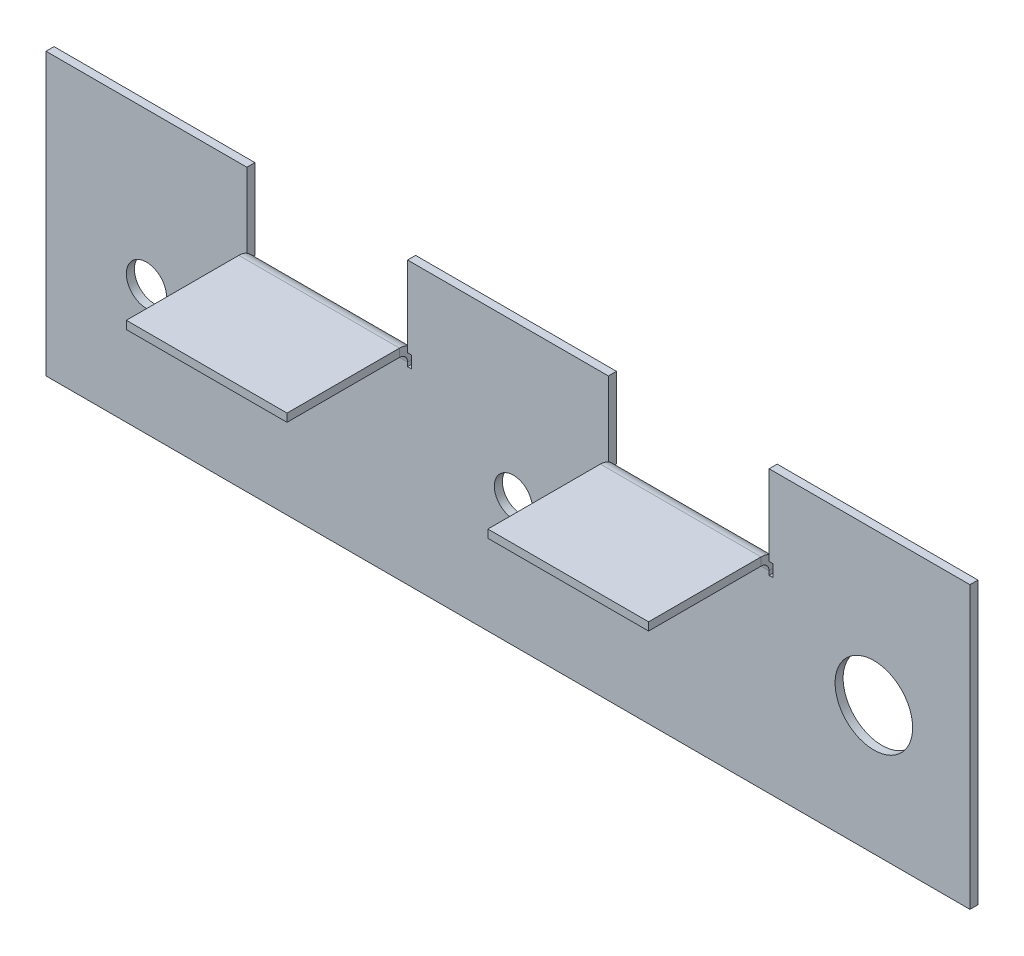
ISO-10303-21;
HEADER;
FILE_DESCRIPTION(('STEP AP214'),'2;1');
FILE_NAME('part.step','',(''),(''),'','','');
FILE_SCHEMA(('AUTOMOTIVE_DESIGN { 1 0 10303 214 1 1 1 1 }'));
ENDSEC;
DATA;
#1=APPLICATION_CONTEXT('core data for automotive mechanical design processes');
#2=APPLICATION_PROTOCOL_DEFINITION('international standard','automotive_design',2000,#1);
#3=PRODUCT_CONTEXT('',#1,'mechanical');
#4=PRODUCT('Part','Part','',(#3));
#5=PRODUCT_RELATED_PRODUCT_CATEGORY('part','',(#4));
#6=PRODUCT_DEFINITION_FORMATION('','',#4);
#7=PRODUCT_DEFINITION_CONTEXT('part definition',#1,'design');
#8=PRODUCT_DEFINITION('design','',#6,#7);
#9=PRODUCT_DEFINITION_SHAPE('','',#8);
#10=(LENGTH_UNIT() NAMED_UNIT(*) SI_UNIT(.MILLI.,.METRE.));
#11=(NAMED_UNIT(*) PLANE_ANGLE_UNIT() SI_UNIT($,.RADIAN.));
#12=(NAMED_UNIT(*) SI_UNIT($,.STERADIAN.) SOLID_ANGLE_UNIT());
#13=UNCERTAINTY_MEASURE_WITH_UNIT(LENGTH_MEASURE(1.E-05),#10,'distance_accuracy_value','');
#14=(GEOMETRIC_REPRESENTATION_CONTEXT(3) GLOBAL_UNCERTAINTY_ASSIGNED_CONTEXT((#13)) GLOBAL_UNIT_ASSIGNED_CONTEXT((#10,
#11,#12)) REPRESENTATION_CONTEXT('',''));
#15=CARTESIAN_POINT('',(0.,0.,0.));
#16=DIRECTION('',(0.,0.,1.));
#17=DIRECTION('',(1.,0.,0.));
#18=AXIS2_PLACEMENT_3D('',#15,#16,#17);
#19=CARTESIAN_POINT('',(0.,0.,1.));
#20=DIRECTION('',(0.,0.,-1.));
#21=DIRECTION('',(-1.,0.,0.));
#22=AXIS2_PLACEMENT_3D('',#19,#20,#21);
#23=PLANE('',#22);
#24=CARTESIAN_POINT('',(58.1713524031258,16.021629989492,1.));
#25=DIRECTION('',(0.,0.,1.));
#26=DIRECTION('',(1.,0.,0.));
#27=AXIS2_PLACEMENT_3D('',#24,#25,#26);
#28=CIRCLE('',#27,2.36837023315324);
#29=CARTESIAN_POINT('',(60.539722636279,16.021629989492,1.));
#30=VERTEX_POINT('',#29);
#31=EDGE_CURVE('E326',#30,#30,#28,.T.);
#32=ORIENTED_EDGE('',*,*,#31,.F.);
#33=EDGE_LOOP('',(#32));
#34=FACE_BOUND('',#33,.T.);
#35=CARTESIAN_POINT('',(12.5,16.021629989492,1.));
#36=DIRECTION('',(0.,0.,1.));
#37=DIRECTION('',(1.,0.,0.));
#38=AXIS2_PLACEMENT_3D('',#35,#36,#37);
#39=CIRCLE('',#38,2.49994635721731);
#40=CARTESIAN_POINT('',(14.9999463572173,16.021629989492,1.));
#41=VERTEX_POINT('',#40);
#42=EDGE_CURVE('E149',#41,#41,#39,.T.);
#43=ORIENTED_EDGE('',*,*,#42,.F.);
#44=EDGE_LOOP('',(#43));
#45=FACE_BOUND('',#44,.T.);
#46=CARTESIAN_POINT('',(103.038810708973,16.021629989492,1.));
#47=DIRECTION('',(0.,0.,1.));
#48=DIRECTION('',(1.,0.,0.));
#49=AXIS2_PLACEMENT_3D('',#46,#47,#48);
#50=CIRCLE('',#49,4.8254545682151);
#51=CARTESIAN_POINT('',(107.864265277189,16.021629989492,1.));
#52=VERTEX_POINT('',#51);
#53=EDGE_CURVE('E320',#52,#52,#50,.T.);
#54=ORIENTED_EDGE('',*,*,#53,.F.);
#55=EDGE_LOOP('',(#54));
#56=FACE_BOUND('',#55,.T.);
#57=DIRECTION('',(-1.,0.,0.));
#58=VECTOR('',#57,1.);
#59=CARTESIAN_POINT('',(70.,25.,1.));
#60=LINE('',#59,#58);
#61=CARTESIAN_POINT('',(70.,25.,1.));
#62=VERTEX_POINT('',#61);
#63=CARTESIAN_POINT('',(69.5,25.,1.));
#64=VERTEX_POINT('',#63);
#65=EDGE_CURVE('E270',#62,#64,#60,.T.);
#66=ORIENTED_EDGE('',*,*,#65,.F.);
#67=DIRECTION('',(0.,1.,0.));
#68=VECTOR('',#67,1.);
#69=CARTESIAN_POINT('',(70.,35.,1.));
#70=LINE('',#69,#68);
#71=CARTESIAN_POINT('',(70.,35.,1.));
#72=VERTEX_POINT('',#71);
#73=EDGE_CURVE('E343',#62,#72,#70,.T.);
#74=ORIENTED_EDGE('',*,*,#73,.T.);
#75=DIRECTION('',(-1.,0.,0.));
#76=VECTOR('',#75,1.);
#77=CARTESIAN_POINT('',(45.,35.,1.));
#78=LINE('',#77,#76);
#79=CARTESIAN_POINT('',(45.,35.,1.));
#80=VERTEX_POINT('',#79);
#81=EDGE_CURVE('E345',#72,#80,#78,.T.);
#82=ORIENTED_EDGE('',*,*,#81,.T.);
#83=DIRECTION('',(0.,-1.,0.));
#84=VECTOR('',#83,1.);
#85=CARTESIAN_POINT('',(45.,25.,1.));
#86=LINE('',#85,#84);
#87=CARTESIAN_POINT('',(45.,25.,1.));
#88=VERTEX_POINT('',#87);
#89=EDGE_CURVE('E130',#80,#88,#86,.T.);
#90=ORIENTED_EDGE('',*,*,#89,.T.);
#91=DIRECTION('',(-1.,0.,0.));
#92=VECTOR('',#91,1.);
#93=CARTESIAN_POINT('',(45.5,25.,1.));
#94=LINE('',#93,#92);
#95=CARTESIAN_POINT('',(45.5,25.,1.));
#96=VERTEX_POINT('',#95);
#97=EDGE_CURVE('E299',#96,#88,#94,.T.);
#98=ORIENTED_EDGE('',*,*,#97,.F.);
#99=DIRECTION('',(0.,1.,0.));
#100=VECTOR('',#99,1.);
#101=CARTESIAN_POINT('',(45.5,23.5,1.));
#102=LINE('',#101,#100);
#103=CARTESIAN_POINT('',(45.5,23.5,1.));
#104=VERTEX_POINT('',#103);
#105=EDGE_CURVE('E295',#104,#96,#102,.T.);
#106=ORIENTED_EDGE('',*,*,#105,.F.);
#107=DIRECTION('',(1.,0.,0.));
#108=VECTOR('',#107,1.);
#109=CARTESIAN_POINT('',(45.,23.5,1.));
#110=LINE('',#109,#108);
#111=CARTESIAN_POINT('',(45.,23.5,1.));
#112=VERTEX_POINT('',#111);
#113=EDGE_CURVE('E291',#112,#104,#110,.T.);
#114=ORIENTED_EDGE('',*,*,#113,.F.);
#115=DIRECTION('',(0.,-1.,0.));
#116=VECTOR('',#115,1.);
#117=CARTESIAN_POINT('',(45.,24.,1.));
#118=LINE('',#117,#116);
#119=CARTESIAN_POINT('',(45.,24.,1.));
#120=VERTEX_POINT('',#119);
#121=EDGE_CURVE('E288',#120,#112,#118,.T.);
#122=ORIENTED_EDGE('',*,*,#121,.F.);
#123=DIRECTION('',(-1.,0.,0.));
#124=VECTOR('',#123,1.);
#125=CARTESIAN_POINT('',(25.,24.,1.));
#126=LINE('',#125,#124);
#127=CARTESIAN_POINT('',(25.,24.,1.));
#128=VERTEX_POINT('',#127);
#129=EDGE_CURVE('E421',#128,#120,#126,.F.);
#130=ORIENTED_EDGE('',*,*,#129,.F.);
#131=DIRECTION('',(0.,1.,0.));
#132=VECTOR('',#131,1.);
#133=CARTESIAN_POINT('',(25.,23.5,1.));
#134=LINE('',#133,#132);
#135=CARTESIAN_POINT('',(25.,23.5,1.));
#136=VERTEX_POINT('',#135);
#137=EDGE_CURVE('E284',#136,#128,#134,.T.);
#138=ORIENTED_EDGE('',*,*,#137,.F.);
#139=DIRECTION('',(1.,0.,0.));
#140=VECTOR('',#139,1.);
#141=CARTESIAN_POINT('',(24.5,23.5,1.));
#142=LINE('',#141,#140);
#143=CARTESIAN_POINT('',(24.5,23.5,1.));
#144=VERTEX_POINT('',#143);
#145=EDGE_CURVE('E280',#144,#136,#142,.T.);
#146=ORIENTED_EDGE('',*,*,#145,.F.);
#147=DIRECTION('',(0.,-1.,0.));
#148=VECTOR('',#147,1.);
#149=CARTESIAN_POINT('',(24.5,25.,1.));
#150=LINE('',#149,#148);
#151=CARTESIAN_POINT('',(24.5,25.,1.));
#152=VERTEX_POINT('',#151);
#153=EDGE_CURVE('E276',#152,#144,#150,.T.);
#154=ORIENTED_EDGE('',*,*,#153,.F.);
#155=DIRECTION('',(-1.,0.,0.));
#156=VECTOR('',#155,1.);
#157=CARTESIAN_POINT('',(25.,25.,1.));
#158=LINE('',#157,#156);
#159=CARTESIAN_POINT('',(25.,25.,1.));
#160=VERTEX_POINT('',#159);
#161=EDGE_CURVE('E127',#160,#152,#158,.T.);
#162=ORIENTED_EDGE('',*,*,#161,.F.);
#163=DIRECTION('',(0.,1.,0.));
#164=VECTOR('',#163,1.);
#165=CARTESIAN_POINT('',(25.,35.,1.));
#166=LINE('',#165,#164);
#167=CARTESIAN_POINT('',(25.,35.,1.));
#168=VERTEX_POINT('',#167);
#169=EDGE_CURVE('E119',#160,#168,#166,.T.);
#170=ORIENTED_EDGE('',*,*,#169,.T.);
#171=DIRECTION('',(-1.,0.,0.));
#172=VECTOR('',#171,1.);
#173=CARTESIAN_POINT('',(0.,35.,1.));
#174=LINE('',#173,#172);
#175=CARTESIAN_POINT('',(0.,35.,1.));
#176=VERTEX_POINT('',#175);
#177=EDGE_CURVE('E123',#168,#176,#174,.T.);
#178=ORIENTED_EDGE('',*,*,#177,.T.);
#179=DIRECTION('',(0.,-1.,0.));
#180=VECTOR('',#179,1.);
#181=CARTESIAN_POINT('',(0.,0.,1.));
#182=LINE('',#181,#180);
#183=CARTESIAN_POINT('',(0.,0.,1.));
#184=VERTEX_POINT('',#183);
#185=EDGE_CURVE('E52',#176,#184,#182,.T.);
#186=ORIENTED_EDGE('',*,*,#185,.T.);
#187=DIRECTION('',(1.,0.,0.));
#188=VECTOR('',#187,1.);
#189=CARTESIAN_POINT('',(115.,0.,1.));
#190=LINE('',#189,#188);
#191=CARTESIAN_POINT('',(115.,0.,1.));
#192=VERTEX_POINT('',#191);
#193=EDGE_CURVE('E166',#184,#192,#190,.T.);
#194=ORIENTED_EDGE('',*,*,#193,.T.);
#195=DIRECTION('',(0.,1.,0.));
#196=VECTOR('',#195,1.);
#197=CARTESIAN_POINT('',(115.,35.,1.));
#198=LINE('',#197,#196);
#199=CARTESIAN_POINT('',(115.,35.,1.));
#200=VERTEX_POINT('',#199);
#201=EDGE_CURVE('E103',#192,#200,#198,.T.);
#202=ORIENTED_EDGE('',*,*,#201,.T.);
#203=DIRECTION('',(-1.,0.,0.));
#204=VECTOR('',#203,1.);
#205=CARTESIAN_POINT('',(90.,35.,1.));
#206=LINE('',#205,#204);
#207=CARTESIAN_POINT('',(90.,35.,1.));
#208=VERTEX_POINT('',#207);
#209=EDGE_CURVE('E338',#200,#208,#206,.T.);
#210=ORIENTED_EDGE('',*,*,#209,.T.);
#211=DIRECTION('',(0.,-1.,0.));
#212=VECTOR('',#211,1.);
#213=CARTESIAN_POINT('',(90.,25.,1.));
#214=LINE('',#213,#212);
#215=CARTESIAN_POINT('',(90.,25.,1.));
#216=VERTEX_POINT('',#215);
#217=EDGE_CURVE('E340',#208,#216,#214,.T.);
#218=ORIENTED_EDGE('',*,*,#217,.T.);
#219=DIRECTION('',(-1.,0.,0.));
#220=VECTOR('',#219,1.);
#221=CARTESIAN_POINT('',(90.5,25.,1.));
#222=LINE('',#221,#220);
#223=CARTESIAN_POINT('',(90.5,25.,1.));
#224=VERTEX_POINT('',#223);
#225=EDGE_CURVE('E460',#224,#216,#222,.T.);
#226=ORIENTED_EDGE('',*,*,#225,.F.);
#227=DIRECTION('',(0.,1.,0.));
#228=VECTOR('',#227,1.);
#229=CARTESIAN_POINT('',(90.5,23.5,1.));
#230=LINE('',#229,#228);
#231=CARTESIAN_POINT('',(90.5,23.5,1.));
#232=VERTEX_POINT('',#231);
#233=EDGE_CURVE('E456',#232,#224,#230,.T.);
#234=ORIENTED_EDGE('',*,*,#233,.F.);
#235=DIRECTION('',(1.,0.,0.));
#236=VECTOR('',#235,1.);
#237=CARTESIAN_POINT('',(90.,23.5,1.));
#238=LINE('',#237,#236);
#239=CARTESIAN_POINT('',(90.,23.5,1.));
#240=VERTEX_POINT('',#239);
#241=EDGE_CURVE('E452',#240,#232,#238,.T.);
#242=ORIENTED_EDGE('',*,*,#241,.F.);
#243=DIRECTION('',(0.,-1.,0.));
#244=VECTOR('',#243,1.);
#245=CARTESIAN_POINT('',(90.,24.,1.));
#246=LINE('',#245,#244);
#247=CARTESIAN_POINT('',(90.,24.,1.));
#248=VERTEX_POINT('',#247);
#249=EDGE_CURVE('E449',#248,#240,#246,.T.);
#250=ORIENTED_EDGE('',*,*,#249,.F.);
#251=DIRECTION('',(-1.,0.,0.));
#252=VECTOR('',#251,1.);
#253=CARTESIAN_POINT('',(70.,24.,1.));
#254=LINE('',#253,#252);
#255=CARTESIAN_POINT('',(70.,24.,1.));
#256=VERTEX_POINT('',#255);
#257=EDGE_CURVE('E501',#256,#248,#254,.F.);
#258=ORIENTED_EDGE('',*,*,#257,.F.);
#259=DIRECTION('',(0.,1.,0.));
#260=VECTOR('',#259,1.);
#261=CARTESIAN_POINT('',(70.,23.5,1.));
#262=LINE('',#261,#260);
#263=CARTESIAN_POINT('',(70.,23.5,1.));
#264=VERTEX_POINT('',#263);
#265=EDGE_CURVE('E257',#264,#256,#262,.T.);
#266=ORIENTED_EDGE('',*,*,#265,.F.);
#267=DIRECTION('',(1.,0.,0.));
#268=VECTOR('',#267,1.);
#269=CARTESIAN_POINT('',(69.5,23.5,1.));
#270=LINE('',#269,#268);
#271=CARTESIAN_POINT('',(69.5,23.5,1.));
#272=VERTEX_POINT('',#271);
#273=EDGE_CURVE('E256',#272,#264,#270,.T.);
#274=ORIENTED_EDGE('',*,*,#273,.F.);
#275=DIRECTION('',(0.,-1.,0.));
#276=VECTOR('',#275,1.);
#277=CARTESIAN_POINT('',(69.5,25.,1.));
#278=LINE('',#277,#276);
#279=EDGE_CURVE('E254',#64,#272,#278,.T.);
#280=ORIENTED_EDGE('',*,*,#279,.F.);
#281=EDGE_LOOP('',(#66,#74,#82,#90,#98,#106,#114,#122,#130,#138,#146,#154,#162,#170,#178,#186,
#194,#202,#210,#218,#226,#234,#242,#250,#258,#266,#274,#280));
#282=FACE_BOUND('',#281,.T.);
#283=ADVANCED_FACE('F35',(#34,#45,#56,#282),#23,.F.);
#284=CARTESIAN_POINT('',(0.,0.,0.));
#285=DIRECTION('',(0.,0.,-1.));
#286=DIRECTION('',(-1.,0.,0.));
#287=AXIS2_PLACEMENT_3D('',#284,#285,#286);
#288=PLANE('',#287);
#289=CARTESIAN_POINT('',(58.1713524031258,16.021629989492,0.));
#290=DIRECTION('',(0.,0.,1.));
#291=DIRECTION('',(1.,0.,0.));
#292=AXIS2_PLACEMENT_3D('',#289,#290,#291);
#293=CIRCLE('',#292,2.36837023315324);
#294=CARTESIAN_POINT('',(60.539722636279,16.021629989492,0.));
#295=VERTEX_POINT('',#294);
#296=EDGE_CURVE('E323',#295,#295,#293,.T.);
#297=ORIENTED_EDGE('',*,*,#296,.T.);
#298=EDGE_LOOP('',(#297));
#299=FACE_BOUND('',#298,.T.);
#300=CARTESIAN_POINT('',(12.5,16.021629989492,0.));
#301=DIRECTION('',(0.,0.,1.));
#302=DIRECTION('',(1.,0.,0.));
#303=AXIS2_PLACEMENT_3D('',#300,#301,#302);
#304=CIRCLE('',#303,2.49994635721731);
#305=CARTESIAN_POINT('',(14.9999463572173,16.021629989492,0.));
#306=VERTEX_POINT('',#305);
#307=EDGE_CURVE('E329',#306,#306,#304,.T.);
#308=ORIENTED_EDGE('',*,*,#307,.T.);
#309=EDGE_LOOP('',(#308));
#310=FACE_BOUND('',#309,.T.);
#311=CARTESIAN_POINT('',(103.038810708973,16.021629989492,0.));
#312=DIRECTION('',(0.,0.,1.));
#313=DIRECTION('',(1.,0.,0.));
#314=AXIS2_PLACEMENT_3D('',#311,#312,#313);
#315=CIRCLE('',#314,4.8254545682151);
#316=CARTESIAN_POINT('',(107.864265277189,16.021629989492,0.));
#317=VERTEX_POINT('',#316);
#318=EDGE_CURVE('E319',#317,#317,#315,.T.);
#319=ORIENTED_EDGE('',*,*,#318,.T.);
#320=EDGE_LOOP('',(#319));
#321=FACE_BOUND('',#320,.T.);
#322=DIRECTION('',(0.,1.,0.));
#323=VECTOR('',#322,1.);
#324=CARTESIAN_POINT('',(70.,35.,0.));
#325=LINE('',#324,#323);
#326=CARTESIAN_POINT('',(70.,25.,0.));
#327=VERTEX_POINT('',#326);
#328=CARTESIAN_POINT('',(70.,35.,0.));
#329=VERTEX_POINT('',#328);
#330=EDGE_CURVE('E156',#327,#329,#325,.T.);
#331=ORIENTED_EDGE('',*,*,#330,.F.);
#332=DIRECTION('',(-1.,0.,0.));
#333=VECTOR('',#332,1.);
#334=CARTESIAN_POINT('',(0.,25.,0.));
#335=LINE('',#334,#333);
#336=CARTESIAN_POINT('',(69.5,25.,0.));
#337=VERTEX_POINT('',#336);
#338=EDGE_CURVE('E267',#327,#337,#335,.T.);
#339=ORIENTED_EDGE('',*,*,#338,.T.);
#340=DIRECTION('',(0.,-1.,0.));
#341=VECTOR('',#340,1.);
#342=CARTESIAN_POINT('',(69.5,0.,0.));
#343=LINE('',#342,#341);
#344=CARTESIAN_POINT('',(69.5,23.5,0.));
#345=VERTEX_POINT('',#344);
#346=EDGE_CURVE('E11',#337,#345,#343,.T.);
#347=ORIENTED_EDGE('',*,*,#346,.T.);
#348=DIRECTION('',(1.,0.,0.));
#349=VECTOR('',#348,1.);
#350=CARTESIAN_POINT('',(0.,23.5,0.));
#351=LINE('',#350,#349);
#352=CARTESIAN_POINT('',(70.,23.5,0.));
#353=VERTEX_POINT('',#352);
#354=EDGE_CURVE('E44',#345,#353,#351,.T.);
#355=ORIENTED_EDGE('',*,*,#354,.T.);
#356=DIRECTION('',(0.,1.,0.));
#357=VECTOR('',#356,1.);
#358=CARTESIAN_POINT('',(70.,0.,0.));
#359=LINE('',#358,#357);
#360=CARTESIAN_POINT('',(70.,24.,0.));
#361=VERTEX_POINT('',#360);
#362=EDGE_CURVE('E220',#353,#361,#359,.T.);
#363=ORIENTED_EDGE('',*,*,#362,.T.);
#364=DIRECTION('',(-1.,0.,0.));
#365=VECTOR('',#364,1.);
#366=CARTESIAN_POINT('',(70.,24.,0.));
#367=LINE('',#366,#365);
#368=CARTESIAN_POINT('',(90.,24.,0.));
#369=VERTEX_POINT('',#368);
#370=EDGE_CURVE('E481',#361,#369,#367,.F.);
#371=ORIENTED_EDGE('',*,*,#370,.T.);
#372=DIRECTION('',(0.,-1.,0.));
#373=VECTOR('',#372,1.);
#374=CARTESIAN_POINT('',(90.,0.,0.));
#375=LINE('',#374,#373);
#376=CARTESIAN_POINT('',(90.,23.5,0.));
#377=VERTEX_POINT('',#376);
#378=EDGE_CURVE('E217',#369,#377,#375,.T.);
#379=ORIENTED_EDGE('',*,*,#378,.T.);
#380=DIRECTION('',(1.,0.,0.));
#381=VECTOR('',#380,1.);
#382=CARTESIAN_POINT('',(0.,23.5,0.));
#383=LINE('',#382,#381);
#384=CARTESIAN_POINT('',(90.5,23.5,0.));
#385=VERTEX_POINT('',#384);
#386=EDGE_CURVE('E214',#377,#385,#383,.T.);
#387=ORIENTED_EDGE('',*,*,#386,.T.);
#388=DIRECTION('',(0.,1.,0.));
#389=VECTOR('',#388,1.);
#390=CARTESIAN_POINT('',(90.5,0.,0.));
#391=LINE('',#390,#389);
#392=CARTESIAN_POINT('',(90.5,25.,0.));
#393=VERTEX_POINT('',#392);
#394=EDGE_CURVE('E211',#385,#393,#391,.T.);
#395=ORIENTED_EDGE('',*,*,#394,.T.);
#396=DIRECTION('',(-1.,0.,0.));
#397=VECTOR('',#396,1.);
#398=CARTESIAN_POINT('',(0.,25.,0.));
#399=LINE('',#398,#397);
#400=CARTESIAN_POINT('',(90.,25.,0.));
#401=VERTEX_POINT('',#400);
#402=EDGE_CURVE('E269',#393,#401,#399,.T.);
#403=ORIENTED_EDGE('',*,*,#402,.T.);
#404=DIRECTION('',(0.,-1.,0.));
#405=VECTOR('',#404,1.);
#406=CARTESIAN_POINT('',(90.,25.,0.));
#407=LINE('',#406,#405);
#408=CARTESIAN_POINT('',(90.,35.,0.));
#409=VERTEX_POINT('',#408);
#410=EDGE_CURVE('E153',#409,#401,#407,.T.);
#411=ORIENTED_EDGE('',*,*,#410,.F.);
#412=DIRECTION('',(-1.,0.,0.));
#413=VECTOR('',#412,1.);
#414=CARTESIAN_POINT('',(90.,35.,0.));
#415=LINE('',#414,#413);
#416=CARTESIAN_POINT('',(115.,35.,0.));
#417=VERTEX_POINT('',#416);
#418=EDGE_CURVE('E151',#417,#409,#415,.T.);
#419=ORIENTED_EDGE('',*,*,#418,.F.);
#420=DIRECTION('',(0.,1.,0.));
#421=VECTOR('',#420,1.);
#422=CARTESIAN_POINT('',(115.,35.,0.));
#423=LINE('',#422,#421);
#424=CARTESIAN_POINT('',(115.,0.,0.));
#425=VERTEX_POINT('',#424);
#426=EDGE_CURVE('E148',#425,#417,#423,.T.);
#427=ORIENTED_EDGE('',*,*,#426,.F.);
#428=DIRECTION('',(1.,0.,0.));
#429=VECTOR('',#428,1.);
#430=CARTESIAN_POINT('',(115.,0.,0.));
#431=LINE('',#430,#429);
#432=CARTESIAN_POINT('',(0.,0.,0.));
#433=VERTEX_POINT('',#432);
#434=EDGE_CURVE('E145',#433,#425,#431,.T.);
#435=ORIENTED_EDGE('',*,*,#434,.F.);
#436=DIRECTION('',(0.,-1.,0.));
#437=VECTOR('',#436,1.);
#438=CARTESIAN_POINT('',(0.,0.,0.));
#439=LINE('',#438,#437);
#440=CARTESIAN_POINT('',(0.,35.,0.));
#441=VERTEX_POINT('',#440);
#442=EDGE_CURVE('E94',#441,#433,#439,.T.);
#443=ORIENTED_EDGE('',*,*,#442,.F.);
#444=DIRECTION('',(-1.,0.,0.));
#445=VECTOR('',#444,1.);
#446=CARTESIAN_POINT('',(0.,35.,0.));
#447=LINE('',#446,#445);
#448=CARTESIAN_POINT('',(25.,35.,0.));
#449=VERTEX_POINT('',#448);
#450=EDGE_CURVE('E88',#449,#441,#447,.T.);
#451=ORIENTED_EDGE('',*,*,#450,.F.);
#452=DIRECTION('',(0.,1.,0.));
#453=VECTOR('',#452,1.);
#454=CARTESIAN_POINT('',(25.,35.,0.));
#455=LINE('',#454,#453);
#456=CARTESIAN_POINT('',(25.,25.,0.));
#457=VERTEX_POINT('',#456);
#458=EDGE_CURVE('E135',#457,#449,#455,.T.);
#459=ORIENTED_EDGE('',*,*,#458,.F.);
#460=DIRECTION('',(-1.,0.,0.));
#461=VECTOR('',#460,1.);
#462=CARTESIAN_POINT('',(0.,25.,0.));
#463=LINE('',#462,#461);
#464=CARTESIAN_POINT('',(24.5,25.,0.));
#465=VERTEX_POINT('',#464);
#466=EDGE_CURVE('E275',#457,#465,#463,.T.);
#467=ORIENTED_EDGE('',*,*,#466,.T.);
#468=DIRECTION('',(0.,-1.,0.));
#469=VECTOR('',#468,1.);
#470=CARTESIAN_POINT('',(24.5,0.,0.));
#471=LINE('',#470,#469);
#472=CARTESIAN_POINT('',(24.5,23.5,0.));
#473=VERTEX_POINT('',#472);
#474=EDGE_CURVE('E208',#465,#473,#471,.T.);
#475=ORIENTED_EDGE('',*,*,#474,.T.);
#476=DIRECTION('',(1.,0.,0.));
#477=VECTOR('',#476,1.);
#478=CARTESIAN_POINT('',(0.,23.5,0.));
#479=LINE('',#478,#477);
#480=CARTESIAN_POINT('',(25.,23.5,0.));
#481=VERTEX_POINT('',#480);
#482=EDGE_CURVE('E205',#473,#481,#479,.T.);
#483=ORIENTED_EDGE('',*,*,#482,.T.);
#484=DIRECTION('',(0.,1.,0.));
#485=VECTOR('',#484,1.);
#486=CARTESIAN_POINT('',(25.,0.,0.));
#487=LINE('',#486,#485);
#488=CARTESIAN_POINT('',(25.,24.,0.));
#489=VERTEX_POINT('',#488);
#490=EDGE_CURVE('E202',#481,#489,#487,.T.);
#491=ORIENTED_EDGE('',*,*,#490,.T.);
#492=DIRECTION('',(-1.,0.,0.));
#493=VECTOR('',#492,1.);
#494=CARTESIAN_POINT('',(25.,24.,0.));
#495=LINE('',#494,#493);
#496=CARTESIAN_POINT('',(45.,24.,0.));
#497=VERTEX_POINT('',#496);
#498=EDGE_CURVE('E547',#489,#497,#495,.F.);
#499=ORIENTED_EDGE('',*,*,#498,.T.);
#500=DIRECTION('',(0.,-1.,0.));
#501=VECTOR('',#500,1.);
#502=CARTESIAN_POINT('',(45.,0.,0.));
#503=LINE('',#502,#501);
#504=CARTESIAN_POINT('',(45.,23.5,0.));
#505=VERTEX_POINT('',#504);
#506=EDGE_CURVE('E199',#497,#505,#503,.T.);
#507=ORIENTED_EDGE('',*,*,#506,.T.);
#508=DIRECTION('',(1.,0.,0.));
#509=VECTOR('',#508,1.);
#510=CARTESIAN_POINT('',(0.,23.5,0.));
#511=LINE('',#510,#509);
#512=CARTESIAN_POINT('',(45.5,23.5,0.));
#513=VERTEX_POINT('',#512);
#514=EDGE_CURVE('E196',#505,#513,#511,.T.);
#515=ORIENTED_EDGE('',*,*,#514,.T.);
#516=DIRECTION('',(0.,1.,0.));
#517=VECTOR('',#516,1.);
#518=CARTESIAN_POINT('',(45.5,0.,0.));
#519=LINE('',#518,#517);
#520=CARTESIAN_POINT('',(45.5,25.,0.));
#521=VERTEX_POINT('',#520);
#522=EDGE_CURVE('E193',#513,#521,#519,.T.);
#523=ORIENTED_EDGE('',*,*,#522,.T.);
#524=DIRECTION('',(-1.,0.,0.));
#525=VECTOR('',#524,1.);
#526=CARTESIAN_POINT('',(0.,25.,0.));
#527=LINE('',#526,#525);
#528=CARTESIAN_POINT('',(45.,25.,0.));
#529=VERTEX_POINT('',#528);
#530=EDGE_CURVE('E316',#521,#529,#527,.T.);
#531=ORIENTED_EDGE('',*,*,#530,.T.);
#532=DIRECTION('',(0.,-1.,0.));
#533=VECTOR('',#532,1.);
#534=CARTESIAN_POINT('',(45.,25.,0.));
#535=LINE('',#534,#533);
#536=CARTESIAN_POINT('',(45.,35.,0.));
#537=VERTEX_POINT('',#536);
#538=EDGE_CURVE('E160',#537,#529,#535,.T.);
#539=ORIENTED_EDGE('',*,*,#538,.F.);
#540=DIRECTION('',(-1.,0.,0.));
#541=VECTOR('',#540,1.);
#542=CARTESIAN_POINT('',(45.,35.,0.));
#543=LINE('',#542,#541);
#544=EDGE_CURVE('E158',#329,#537,#543,.T.);
#545=ORIENTED_EDGE('',*,*,#544,.F.);
#546=EDGE_LOOP('',(#331,#339,#347,#355,#363,#371,#379,#387,#395,#403,#411,#419,#427,#435,#443,
#451,#459,#467,#475,#483,#491,#499,#507,#515,#523,#531,#539,#545));
#547=FACE_BOUND('',#546,.T.);
#548=ADVANCED_FACE('F227',(#299,#310,#321,#547),#288,.T.);
#549=CARTESIAN_POINT('',(115.,0.,1.));
#550=DIRECTION('',(0.,1.,0.));
#551=DIRECTION('',(-1.,0.,0.));
#552=AXIS2_PLACEMENT_3D('',#549,#550,#551);
#553=PLANE('',#552);
#554=ORIENTED_EDGE('',*,*,#434,.T.);
#555=DIRECTION('',(0.,0.,-1.));
#556=VECTOR('',#555,1.);
#557=CARTESIAN_POINT('',(115.,0.,1.));
#558=LINE('',#557,#556);
#559=EDGE_CURVE('E191',#192,#425,#558,.T.);
#560=ORIENTED_EDGE('',*,*,#559,.F.);
#561=ORIENTED_EDGE('',*,*,#193,.F.);
#562=DIRECTION('',(0.,0.,-1.));
#563=VECTOR('',#562,1.);
#564=CARTESIAN_POINT('',(0.,0.,1.));
#565=LINE('',#564,#563);
#566=EDGE_CURVE('E141',#184,#433,#565,.T.);
#567=ORIENTED_EDGE('',*,*,#566,.T.);
#568=EDGE_LOOP('',(#554,#560,#561,#567));
#569=FACE_BOUND('',#568,.T.);
#570=ADVANCED_FACE('F37',(#569),#553,.F.);
#571=CARTESIAN_POINT('',(115.,35.,1.));
#572=DIRECTION('',(-1.,0.,0.));
#573=DIRECTION('',(0.,0.,1.));
#574=AXIS2_PLACEMENT_3D('',#571,#572,#573);
#575=PLANE('',#574);
#576=ORIENTED_EDGE('',*,*,#426,.T.);
#577=DIRECTION('',(0.,0.,-1.));
#578=VECTOR('',#577,1.);
#579=CARTESIAN_POINT('',(115.,35.,1.));
#580=LINE('',#579,#578);
#581=EDGE_CURVE('E188',#200,#417,#580,.T.);
#582=ORIENTED_EDGE('',*,*,#581,.F.);
#583=ORIENTED_EDGE('',*,*,#201,.F.);
#584=ORIENTED_EDGE('',*,*,#559,.T.);
#585=EDGE_LOOP('',(#576,#582,#583,#584));
#586=FACE_BOUND('',#585,.T.);
#587=ADVANCED_FACE('F618',(#586),#575,.F.);
#588=CARTESIAN_POINT('',(90.,35.,1.));
#589=DIRECTION('',(0.,-1.,0.));
#590=DIRECTION('',(1.,0.,0.));
#591=AXIS2_PLACEMENT_3D('',#588,#589,#590);
#592=PLANE('',#591);
#593=ORIENTED_EDGE('',*,*,#418,.T.);
#594=DIRECTION('',(0.,0.,-1.));
#595=VECTOR('',#594,1.);
#596=CARTESIAN_POINT('',(90.,35.,1.));
#597=LINE('',#596,#595);
#598=EDGE_CURVE('E185',#208,#409,#597,.T.);
#599=ORIENTED_EDGE('',*,*,#598,.F.);
#600=ORIENTED_EDGE('',*,*,#209,.F.);
#601=ORIENTED_EDGE('',*,*,#581,.T.);
#602=EDGE_LOOP('',(#593,#599,#600,#601));
#603=FACE_BOUND('',#602,.T.);
#604=ADVANCED_FACE('F615',(#603),#592,.F.);
#605=CARTESIAN_POINT('',(90.,25.,1.));
#606=DIRECTION('',(1.,0.,0.));
#607=DIRECTION('',(0.,0.,-1.));
#608=AXIS2_PLACEMENT_3D('',#605,#606,#607);
#609=PLANE('',#608);
#610=ORIENTED_EDGE('',*,*,#410,.T.);
#611=DIRECTION('',(0.,0.,-1.));
#612=VECTOR('',#611,1.);
#613=CARTESIAN_POINT('',(90.,25.,1.));
#614=LINE('',#613,#612);
#615=EDGE_CURVE('E182',#216,#401,#614,.T.);
#616=ORIENTED_EDGE('',*,*,#615,.F.);
#617=ORIENTED_EDGE('',*,*,#217,.F.);
#618=ORIENTED_EDGE('',*,*,#598,.T.);
#619=EDGE_LOOP('',(#610,#616,#617,#618));
#620=FACE_BOUND('',#619,.T.);
#621=ADVANCED_FACE('F611',(#620),#609,.F.);
#622=CARTESIAN_POINT('',(70.,35.,1.));
#623=DIRECTION('',(-1.,0.,0.));
#624=DIRECTION('',(0.,-1.,0.));
#625=AXIS2_PLACEMENT_3D('',#622,#623,#624);
#626=PLANE('',#625);
#627=ORIENTED_EDGE('',*,*,#330,.T.);
#628=DIRECTION('',(0.,0.,-1.));
#629=VECTOR('',#628,1.);
#630=CARTESIAN_POINT('',(70.,35.,1.));
#631=LINE('',#630,#629);
#632=EDGE_CURVE('E176',#72,#329,#631,.T.);
#633=ORIENTED_EDGE('',*,*,#632,.F.);
#634=ORIENTED_EDGE('',*,*,#73,.F.);
#635=DIRECTION('',(0.,0.,-1.));
#636=VECTOR('',#635,1.);
#637=CARTESIAN_POINT('',(70.,25.,1.));
#638=LINE('',#637,#636);
#639=EDGE_CURVE('E179',#62,#327,#638,.T.);
#640=ORIENTED_EDGE('',*,*,#639,.T.);
#641=EDGE_LOOP('',(#627,#633,#634,#640));
#642=FACE_BOUND('',#641,.T.);
#643=ADVANCED_FACE('F607',(#642),#626,.F.);
#644=CARTESIAN_POINT('',(45.,35.,1.));
#645=DIRECTION('',(0.,-1.,0.));
#646=DIRECTION('',(1.,0.,0.));
#647=AXIS2_PLACEMENT_3D('',#644,#645,#646);
#648=PLANE('',#647);
#649=ORIENTED_EDGE('',*,*,#544,.T.);
#650=DIRECTION('',(0.,0.,-1.));
#651=VECTOR('',#650,1.);
#652=CARTESIAN_POINT('',(45.,35.,1.));
#653=LINE('',#652,#651);
#654=EDGE_CURVE('E173',#80,#537,#653,.T.);
#655=ORIENTED_EDGE('',*,*,#654,.F.);
#656=ORIENTED_EDGE('',*,*,#81,.F.);
#657=ORIENTED_EDGE('',*,*,#632,.T.);
#658=EDGE_LOOP('',(#649,#655,#656,#657));
#659=FACE_BOUND('',#658,.T.);
#660=ADVANCED_FACE('F604',(#659),#648,.F.);
#661=CARTESIAN_POINT('',(45.,25.,1.));
#662=DIRECTION('',(1.,0.,0.));
#663=DIRECTION('',(0.,0.,-1.));
#664=AXIS2_PLACEMENT_3D('',#661,#662,#663);
#665=PLANE('',#664);
#666=ORIENTED_EDGE('',*,*,#538,.T.);
#667=DIRECTION('',(0.,0.,-1.));
#668=VECTOR('',#667,1.);
#669=CARTESIAN_POINT('',(45.,25.,1.));
#670=LINE('',#669,#668);
#671=EDGE_CURVE('E170',#88,#529,#670,.T.);
#672=ORIENTED_EDGE('',*,*,#671,.F.);
#673=ORIENTED_EDGE('',*,*,#89,.F.);
#674=ORIENTED_EDGE('',*,*,#654,.T.);
#675=EDGE_LOOP('',(#666,#672,#673,#674));
#676=FACE_BOUND('',#675,.T.);
#677=ADVANCED_FACE('F358',(#676),#665,.F.);
#678=CARTESIAN_POINT('',(25.,35.,1.));
#679=DIRECTION('',(-1.,0.,0.));
#680=DIRECTION('',(0.,-1.,0.));
#681=AXIS2_PLACEMENT_3D('',#678,#679,#680);
#682=PLANE('',#681);
#683=ORIENTED_EDGE('',*,*,#458,.T.);
#684=DIRECTION('',(0.,0.,-1.));
#685=VECTOR('',#684,1.);
#686=CARTESIAN_POINT('',(25.,35.,1.));
#687=LINE('',#686,#685);
#688=EDGE_CURVE('E132',#168,#449,#687,.T.);
#689=ORIENTED_EDGE('',*,*,#688,.F.);
#690=ORIENTED_EDGE('',*,*,#169,.F.);
#691=DIRECTION('',(0.,0.,-1.));
#692=VECTOR('',#691,1.);
#693=CARTESIAN_POINT('',(25.,25.,1.));
#694=LINE('',#693,#692);
#695=EDGE_CURVE('E136',#160,#457,#694,.T.);
#696=ORIENTED_EDGE('',*,*,#695,.T.);
#697=EDGE_LOOP('',(#683,#689,#690,#696));
#698=FACE_BOUND('',#697,.T.);
#699=ADVANCED_FACE('F133',(#698),#682,.F.);
#700=CARTESIAN_POINT('',(0.,35.,1.));
#701=DIRECTION('',(0.,-1.,0.));
#702=DIRECTION('',(0.,0.,-1.));
#703=AXIS2_PLACEMENT_3D('',#700,#701,#702);
#704=PLANE('',#703);
#705=ORIENTED_EDGE('',*,*,#450,.T.);
#706=DIRECTION('',(0.,0.,-1.));
#707=VECTOR('',#706,1.);
#708=CARTESIAN_POINT('',(0.,35.,1.));
#709=LINE('',#708,#707);
#710=EDGE_CURVE('E137',#176,#441,#709,.T.);
#711=ORIENTED_EDGE('',*,*,#710,.F.);
#712=ORIENTED_EDGE('',*,*,#177,.F.);
#713=ORIENTED_EDGE('',*,*,#688,.T.);
#714=EDGE_LOOP('',(#705,#711,#712,#713));
#715=FACE_BOUND('',#714,.T.);
#716=ADVANCED_FACE('F139',(#715),#704,.F.);
#717=CARTESIAN_POINT('',(0.,0.,1.));
#718=DIRECTION('',(1.,0.,0.));
#719=DIRECTION('',(0.,0.,-1.));
#720=AXIS2_PLACEMENT_3D('',#717,#718,#719);
#721=PLANE('',#720);
#722=ORIENTED_EDGE('',*,*,#442,.T.);
#723=ORIENTED_EDGE('',*,*,#566,.F.);
#724=ORIENTED_EDGE('',*,*,#185,.F.);
#725=ORIENTED_EDGE('',*,*,#710,.T.);
#726=EDGE_LOOP('',(#722,#723,#724,#725));
#727=FACE_BOUND('',#726,.T.);
#728=ADVANCED_FACE('F595',(#727),#721,.F.);
#729=CARTESIAN_POINT('',(12.5,16.021629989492,1.));
#730=DIRECTION('',(0.,0.,-1.));
#731=DIRECTION('',(-1.,0.,0.));
#732=AXIS2_PLACEMENT_3D('',#729,#730,#731);
#733=CYLINDRICAL_SURFACE('',#732,2.49994635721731);
#734=ORIENTED_EDGE('',*,*,#42,.T.);
#735=EDGE_LOOP('',(#734));
#736=FACE_BOUND('',#735,.T.);
#737=ORIENTED_EDGE('',*,*,#307,.F.);
#738=EDGE_LOOP('',(#737));
#739=FACE_BOUND('',#738,.T.);
#740=ADVANCED_FACE('F592',(#736,#739),#733,.F.);
#741=CARTESIAN_POINT('',(58.1713524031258,16.021629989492,1.));
#742=DIRECTION('',(0.,0.,-1.));
#743=DIRECTION('',(-1.,0.,0.));
#744=AXIS2_PLACEMENT_3D('',#741,#742,#743);
#745=CYLINDRICAL_SURFACE('',#744,2.36837023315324);
#746=ORIENTED_EDGE('',*,*,#31,.T.);
#747=EDGE_LOOP('',(#746));
#748=FACE_BOUND('',#747,.T.);
#749=ORIENTED_EDGE('',*,*,#296,.F.);
#750=EDGE_LOOP('',(#749));
#751=FACE_BOUND('',#750,.T.);
#752=ADVANCED_FACE('F785',(#748,#751),#745,.F.);
#753=CARTESIAN_POINT('',(103.038810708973,16.021629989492,1.));
#754=DIRECTION('',(0.,0.,-1.));
#755=DIRECTION('',(-1.,0.,0.));
#756=AXIS2_PLACEMENT_3D('',#753,#754,#755);
#757=CYLINDRICAL_SURFACE('',#756,4.8254545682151);
#758=ORIENTED_EDGE('',*,*,#53,.T.);
#759=EDGE_LOOP('',(#758));
#760=FACE_BOUND('',#759,.T.);
#761=ORIENTED_EDGE('',*,*,#318,.F.);
#762=EDGE_LOOP('',(#761));
#763=FACE_BOUND('',#762,.T.);
#764=ADVANCED_FACE('F778',(#760,#763),#757,.F.);
#765=CARTESIAN_POINT('',(25.,25.,1.));
#766=DIRECTION('',(0.,-1.,0.));
#767=DIRECTION('',(0.,0.,-1.));
#768=AXIS2_PLACEMENT_3D('',#765,#766,#767);
#769=PLANE('',#768);
#770=ORIENTED_EDGE('',*,*,#466,.F.);
#771=ORIENTED_EDGE('',*,*,#695,.F.);
#772=ORIENTED_EDGE('',*,*,#161,.T.);
#773=DIRECTION('',(0.,0.,-1.));
#774=VECTOR('',#773,1.);
#775=CARTESIAN_POINT('',(24.5,25.,1.));
#776=LINE('',#775,#774);
#777=EDGE_CURVE('E279',#152,#465,#776,.T.);
#778=ORIENTED_EDGE('',*,*,#777,.T.);
#779=EDGE_LOOP('',(#770,#771,#772,#778));
#780=FACE_BOUND('',#779,.T.);
#781=ADVANCED_FACE('F409',(#780),#769,.T.);
#782=CARTESIAN_POINT('',(24.5,25.,1.));
#783=DIRECTION('',(1.,0.,0.));
#784=DIRECTION('',(0.,0.,-1.));
#785=AXIS2_PLACEMENT_3D('',#782,#783,#784);
#786=PLANE('',#785);
#787=ORIENTED_EDGE('',*,*,#474,.F.);
#788=ORIENTED_EDGE('',*,*,#777,.F.);
#789=ORIENTED_EDGE('',*,*,#153,.T.);
#790=DIRECTION('',(0.,0.,-1.));
#791=VECTOR('',#790,1.);
#792=CARTESIAN_POINT('',(24.5,23.5,1.));
#793=LINE('',#792,#791);
#794=EDGE_CURVE('E283',#144,#473,#793,.T.);
#795=ORIENTED_EDGE('',*,*,#794,.T.);
#796=EDGE_LOOP('',(#787,#788,#789,#795));
#797=FACE_BOUND('',#796,.T.);
#798=ADVANCED_FACE('F404',(#797),#786,.T.);
#799=CARTESIAN_POINT('',(24.5,23.5,1.));
#800=DIRECTION('',(0.,1.,0.));
#801=DIRECTION('',(0.,0.,1.));
#802=AXIS2_PLACEMENT_3D('',#799,#800,#801);
#803=PLANE('',#802);
#804=ORIENTED_EDGE('',*,*,#482,.F.);
#805=ORIENTED_EDGE('',*,*,#794,.F.);
#806=ORIENTED_EDGE('',*,*,#145,.T.);
#807=DIRECTION('',(0.,0.,-1.));
#808=VECTOR('',#807,1.);
#809=CARTESIAN_POINT('',(25.,23.5,1.));
#810=LINE('',#809,#808);
#811=EDGE_CURVE('E287',#136,#481,#810,.T.);
#812=ORIENTED_EDGE('',*,*,#811,.T.);
#813=EDGE_LOOP('',(#804,#805,#806,#812));
#814=FACE_BOUND('',#813,.T.);
#815=ADVANCED_FACE('F401',(#814),#803,.T.);
#816=CARTESIAN_POINT('',(25.,23.5,1.));
#817=DIRECTION('',(-1.,0.,0.));
#818=DIRECTION('',(0.,0.,1.));
#819=AXIS2_PLACEMENT_3D('',#816,#817,#818);
#820=PLANE('',#819);
#821=ORIENTED_EDGE('',*,*,#490,.F.);
#822=ORIENTED_EDGE('',*,*,#811,.F.);
#823=ORIENTED_EDGE('',*,*,#137,.T.);
#824=DIRECTION('',(0.,0.,-1.));
#825=VECTOR('',#824,1.);
#826=CARTESIAN_POINT('',(25.,24.,1.));
#827=LINE('',#826,#825);
#828=EDGE_CURVE('E443',#128,#489,#827,.T.);
#829=ORIENTED_EDGE('',*,*,#828,.T.);
#830=EDGE_LOOP('',(#821,#822,#823,#829));
#831=FACE_BOUND('',#830,.T.);
#832=ADVANCED_FACE('F416',(#831),#820,.T.);
#833=CARTESIAN_POINT('',(45.,24.,1.));
#834=DIRECTION('',(1.,0.,0.));
#835=DIRECTION('',(0.,0.,-1.));
#836=AXIS2_PLACEMENT_3D('',#833,#834,#835);
#837=PLANE('',#836);
#838=ORIENTED_EDGE('',*,*,#506,.F.);
#839=DIRECTION('',(0.,0.,-1.));
#840=VECTOR('',#839,1.);
#841=CARTESIAN_POINT('',(45.,24.,1.));
#842=LINE('',#841,#840);
#843=EDGE_CURVE('E439',#120,#497,#842,.T.);
#844=ORIENTED_EDGE('',*,*,#843,.F.);
#845=ORIENTED_EDGE('',*,*,#121,.T.);
#846=DIRECTION('',(0.,0.,-1.));
#847=VECTOR('',#846,1.);
#848=CARTESIAN_POINT('',(45.,23.5,1.));
#849=LINE('',#848,#847);
#850=EDGE_CURVE('E294',#112,#505,#849,.T.);
#851=ORIENTED_EDGE('',*,*,#850,.T.);
#852=EDGE_LOOP('',(#838,#844,#845,#851));
#853=FACE_BOUND('',#852,.T.);
#854=ADVANCED_FACE('F572',(#853),#837,.T.);
#855=CARTESIAN_POINT('',(45.,23.5,1.));
#856=DIRECTION('',(0.,1.,0.));
#857=DIRECTION('',(0.,0.,1.));
#858=AXIS2_PLACEMENT_3D('',#855,#856,#857);
#859=PLANE('',#858);
#860=ORIENTED_EDGE('',*,*,#514,.F.);
#861=ORIENTED_EDGE('',*,*,#850,.F.);
#862=ORIENTED_EDGE('',*,*,#113,.T.);
#863=DIRECTION('',(0.,0.,-1.));
#864=VECTOR('',#863,1.);
#865=CARTESIAN_POINT('',(45.5,23.5,1.));
#866=LINE('',#865,#864);
#867=EDGE_CURVE('E298',#104,#513,#866,.T.);
#868=ORIENTED_EDGE('',*,*,#867,.T.);
#869=EDGE_LOOP('',(#860,#861,#862,#868));
#870=FACE_BOUND('',#869,.T.);
#871=ADVANCED_FACE('F379',(#870),#859,.T.);
#872=CARTESIAN_POINT('',(45.5,23.5,1.));
#873=DIRECTION('',(-1.,0.,0.));
#874=DIRECTION('',(0.,0.,1.));
#875=AXIS2_PLACEMENT_3D('',#872,#873,#874);
#876=PLANE('',#875);
#877=ORIENTED_EDGE('',*,*,#522,.F.);
#878=ORIENTED_EDGE('',*,*,#867,.F.);
#879=ORIENTED_EDGE('',*,*,#105,.T.);
#880=DIRECTION('',(0.,0.,-1.));
#881=VECTOR('',#880,1.);
#882=CARTESIAN_POINT('',(45.5,25.,1.));
#883=LINE('',#882,#881);
#884=EDGE_CURVE('E273',#96,#521,#883,.T.);
#885=ORIENTED_EDGE('',*,*,#884,.T.);
#886=EDGE_LOOP('',(#877,#878,#879,#885));
#887=FACE_BOUND('',#886,.T.);
#888=ADVANCED_FACE('F374',(#887),#876,.T.);
#889=CARTESIAN_POINT('',(45.5,25.,1.));
#890=DIRECTION('',(0.,-1.,0.));
#891=DIRECTION('',(0.,0.,-1.));
#892=AXIS2_PLACEMENT_3D('',#889,#890,#891);
#893=PLANE('',#892);
#894=ORIENTED_EDGE('',*,*,#530,.F.);
#895=ORIENTED_EDGE('',*,*,#884,.F.);
#896=ORIENTED_EDGE('',*,*,#97,.T.);
#897=ORIENTED_EDGE('',*,*,#671,.T.);
#898=EDGE_LOOP('',(#894,#895,#896,#897));
#899=FACE_BOUND('',#898,.T.);
#900=ADVANCED_FACE('F363',(#899),#893,.T.);
#901=CARTESIAN_POINT('',(70.,25.,1.));
#902=DIRECTION('',(0.,-1.,0.));
#903=DIRECTION('',(0.,0.,-1.));
#904=AXIS2_PLACEMENT_3D('',#901,#902,#903);
#905=PLANE('',#904);
#906=ORIENTED_EDGE('',*,*,#338,.F.);
#907=ORIENTED_EDGE('',*,*,#639,.F.);
#908=ORIENTED_EDGE('',*,*,#65,.T.);
#909=DIRECTION('',(0.,0.,-1.));
#910=VECTOR('',#909,1.);
#911=CARTESIAN_POINT('',(69.5,25.,1.));
#912=LINE('',#911,#910);
#913=EDGE_CURVE('E259',#64,#337,#912,.T.);
#914=ORIENTED_EDGE('',*,*,#913,.T.);
#915=EDGE_LOOP('',(#906,#907,#908,#914));
#916=FACE_BOUND('',#915,.T.);
#917=ADVANCED_FACE('F774',(#916),#905,.T.);
#918=CARTESIAN_POINT('',(69.5,25.,1.));
#919=DIRECTION('',(1.,0.,0.));
#920=DIRECTION('',(0.,0.,-1.));
#921=AXIS2_PLACEMENT_3D('',#918,#919,#920);
#922=PLANE('',#921);
#923=ORIENTED_EDGE('',*,*,#346,.F.);
#924=ORIENTED_EDGE('',*,*,#913,.F.);
#925=ORIENTED_EDGE('',*,*,#279,.T.);
#926=DIRECTION('',(0.,0.,-1.));
#927=VECTOR('',#926,1.);
#928=CARTESIAN_POINT('',(69.5,23.5,1.));
#929=LINE('',#928,#927);
#930=EDGE_CURVE('E243',#272,#345,#929,.T.);
#931=ORIENTED_EDGE('',*,*,#930,.T.);
#932=EDGE_LOOP('',(#923,#924,#925,#931));
#933=FACE_BOUND('',#932,.T.);
#934=ADVANCED_FACE('F249',(#933),#922,.T.);
#935=CARTESIAN_POINT('',(69.5,23.5,1.));
#936=DIRECTION('',(0.,1.,0.));
#937=DIRECTION('',(0.,0.,1.));
#938=AXIS2_PLACEMENT_3D('',#935,#936,#937);
#939=PLANE('',#938);
#940=ORIENTED_EDGE('',*,*,#354,.F.);
#941=ORIENTED_EDGE('',*,*,#930,.F.);
#942=ORIENTED_EDGE('',*,*,#273,.T.);
#943=DIRECTION('',(0.,0.,-1.));
#944=VECTOR('',#943,1.);
#945=CARTESIAN_POINT('',(70.,23.5,1.));
#946=LINE('',#945,#944);
#947=EDGE_CURVE('E246',#264,#353,#946,.T.);
#948=ORIENTED_EDGE('',*,*,#947,.T.);
#949=EDGE_LOOP('',(#940,#941,#942,#948));
#950=FACE_BOUND('',#949,.T.);
#951=ADVANCED_FACE('F240',(#950),#939,.T.);
#952=CARTESIAN_POINT('',(70.,23.5,1.));
#953=DIRECTION('',(-1.,0.,0.));
#954=DIRECTION('',(0.,0.,1.));
#955=AXIS2_PLACEMENT_3D('',#952,#953,#954);
#956=PLANE('',#955);
#957=ORIENTED_EDGE('',*,*,#362,.F.);
#958=ORIENTED_EDGE('',*,*,#947,.F.);
#959=ORIENTED_EDGE('',*,*,#265,.T.);
#960=DIRECTION('',(0.,0.,-1.));
#961=VECTOR('',#960,1.);
#962=CARTESIAN_POINT('',(70.,24.,1.));
#963=LINE('',#962,#961);
#964=EDGE_CURVE('E491',#256,#361,#963,.T.);
#965=ORIENTED_EDGE('',*,*,#964,.T.);
#966=EDGE_LOOP('',(#957,#958,#959,#965));
#967=FACE_BOUND('',#966,.T.);
#968=ADVANCED_FACE('F997',(#967),#956,.T.);
#969=CARTESIAN_POINT('',(90.,24.,1.));
#970=DIRECTION('',(1.,0.,0.));
#971=DIRECTION('',(0.,0.,-1.));
#972=AXIS2_PLACEMENT_3D('',#969,#970,#971);
#973=PLANE('',#972);
#974=ORIENTED_EDGE('',*,*,#378,.F.);
#975=DIRECTION('',(0.,0.,-1.));
#976=VECTOR('',#975,1.);
#977=CARTESIAN_POINT('',(90.,24.,1.));
#978=LINE('',#977,#976);
#979=EDGE_CURVE('E507',#248,#369,#978,.T.);
#980=ORIENTED_EDGE('',*,*,#979,.F.);
#981=ORIENTED_EDGE('',*,*,#249,.T.);
#982=DIRECTION('',(0.,0.,-1.));
#983=VECTOR('',#982,1.);
#984=CARTESIAN_POINT('',(90.,23.5,1.));
#985=LINE('',#984,#983);
#986=EDGE_CURVE('E455',#240,#377,#985,.T.);
#987=ORIENTED_EDGE('',*,*,#986,.T.);
#988=EDGE_LOOP('',(#974,#980,#981,#987));
#989=FACE_BOUND('',#988,.T.);
#990=ADVANCED_FACE('F471',(#989),#973,.T.);
#991=CARTESIAN_POINT('',(90.,23.5,1.));
#992=DIRECTION('',(0.,1.,0.));
#993=DIRECTION('',(0.,0.,1.));
#994=AXIS2_PLACEMENT_3D('',#991,#992,#993);
#995=PLANE('',#994);
#996=ORIENTED_EDGE('',*,*,#386,.F.);
#997=ORIENTED_EDGE('',*,*,#986,.F.);
#998=ORIENTED_EDGE('',*,*,#241,.T.);
#999=DIRECTION('',(0.,0.,-1.));
#1000=VECTOR('',#999,1.);
#1001=CARTESIAN_POINT('',(90.5,23.5,1.));
#1002=LINE('',#1001,#1000);
#1003=EDGE_CURVE('E459',#232,#385,#1002,.T.);
#1004=ORIENTED_EDGE('',*,*,#1003,.T.);
#1005=EDGE_LOOP('',(#996,#997,#998,#1004));
#1006=FACE_BOUND('',#1005,.T.);
#1007=ADVANCED_FACE('F762',(#1006),#995,.T.);
#1008=CARTESIAN_POINT('',(90.5,23.5,1.));
#1009=DIRECTION('',(-1.,0.,0.));
#1010=DIRECTION('',(0.,0.,1.));
#1011=AXIS2_PLACEMENT_3D('',#1008,#1009,#1010);
#1012=PLANE('',#1011);
#1013=ORIENTED_EDGE('',*,*,#394,.F.);
#1014=ORIENTED_EDGE('',*,*,#1003,.F.);
#1015=ORIENTED_EDGE('',*,*,#233,.T.);
#1016=DIRECTION('',(0.,0.,-1.));
#1017=VECTOR('',#1016,1.);
#1018=CARTESIAN_POINT('',(90.5,25.,1.));
#1019=LINE('',#1018,#1017);
#1020=EDGE_CURVE('E442',#224,#393,#1019,.T.);
#1021=ORIENTED_EDGE('',*,*,#1020,.T.);
#1022=EDGE_LOOP('',(#1013,#1014,#1015,#1021));
#1023=FACE_BOUND('',#1022,.T.);
#1024=ADVANCED_FACE('F764',(#1023),#1012,.T.);
#1025=CARTESIAN_POINT('',(90.5,25.,1.));
#1026=DIRECTION('',(0.,-1.,0.));
#1027=DIRECTION('',(0.,0.,-1.));
#1028=AXIS2_PLACEMENT_3D('',#1025,#1026,#1027);
#1029=PLANE('',#1028);
#1030=ORIENTED_EDGE('',*,*,#402,.F.);
#1031=ORIENTED_EDGE('',*,*,#1020,.F.);
#1032=ORIENTED_EDGE('',*,*,#225,.T.);
#1033=ORIENTED_EDGE('',*,*,#615,.T.);
#1034=EDGE_LOOP('',(#1030,#1031,#1032,#1033));
#1035=FACE_BOUND('',#1034,.T.);
#1036=ADVANCED_FACE('F765',(#1035),#1029,.T.);
#1037=CARTESIAN_POINT('',(45.,24.,2.));
#1038=DIRECTION('',(1.,0.,0.));
#1039=DIRECTION('',(0.,0.,-1.));
#1040=AXIS2_PLACEMENT_3D('',#1037,#1038,#1039);
#1041=PLANE('',#1040);
#1042=DIRECTION('',(0.,1.,0.));
#1043=VECTOR('',#1042,1.);
#1044=CARTESIAN_POINT('',(45.,25.,2.));
#1045=LINE('',#1044,#1043);
#1046=CARTESIAN_POINT('',(45.,25.,2.));
#1047=VERTEX_POINT('',#1046);
#1048=CARTESIAN_POINT('',(45.,26.,1.99999999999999));
#1049=VERTEX_POINT('',#1048);
#1050=EDGE_CURVE('E510',#1047,#1049,#1045,.T.);
#1051=ORIENTED_EDGE('',*,*,#1050,.F.);
#1052=CARTESIAN_POINT('',(45.,24.,2.));
#1053=DIRECTION('',(-1.,0.,0.));
#1054=DIRECTION('',(0.,0.,1.));
#1055=AXIS2_PLACEMENT_3D('',#1052,#1053,#1054);
#1056=CIRCLE('',#1055,1.);
#1057=EDGE_CURVE('E430',#120,#1047,#1056,.F.);
#1058=ORIENTED_EDGE('',*,*,#1057,.F.);
#1059=ORIENTED_EDGE('',*,*,#843,.T.);
#1060=CARTESIAN_POINT('',(45.,24.,2.));
#1061=DIRECTION('',(-1.,0.,0.));
#1062=DIRECTION('',(0.,0.,1.));
#1063=AXIS2_PLACEMENT_3D('',#1060,#1061,#1062);
#1064=CIRCLE('',#1063,2.);
#1065=EDGE_CURVE('E445',#497,#1049,#1064,.F.);
#1066=ORIENTED_EDGE('',*,*,#1065,.T.);
#1067=EDGE_LOOP('',(#1051,#1058,#1059,#1066));
#1068=FACE_BOUND('',#1067,.T.);
#1069=ADVANCED_FACE('F570',(#1068),#1041,.T.);
#1070=CARTESIAN_POINT('',(25.,24.,2.));
#1071=DIRECTION('',(1.,0.,0.));
#1072=DIRECTION('',(0.,0.,-1.));
#1073=AXIS2_PLACEMENT_3D('',#1070,#1071,#1072);
#1074=PLANE('',#1073);
#1075=CARTESIAN_POINT('',(25.,24.,2.));
#1076=DIRECTION('',(-1.,0.,0.));
#1077=DIRECTION('',(0.,0.,1.));
#1078=AXIS2_PLACEMENT_3D('',#1075,#1076,#1077);
#1079=CIRCLE('',#1078,1.);
#1080=CARTESIAN_POINT('',(25.,25.,2.));
#1081=VERTEX_POINT('',#1080);
#1082=EDGE_CURVE('E431',#1081,#128,#1079,.T.);
#1083=ORIENTED_EDGE('',*,*,#1082,.F.);
#1084=DIRECTION('',(0.,1.,0.));
#1085=VECTOR('',#1084,1.);
#1086=CARTESIAN_POINT('',(25.,25.,2.));
#1087=LINE('',#1086,#1085);
#1088=CARTESIAN_POINT('',(25.,26.,1.99999999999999));
#1089=VERTEX_POINT('',#1088);
#1090=EDGE_CURVE('E516',#1081,#1089,#1087,.T.);
#1091=ORIENTED_EDGE('',*,*,#1090,.T.);
#1092=CARTESIAN_POINT('',(25.,24.,2.));
#1093=DIRECTION('',(-1.,0.,0.));
#1094=DIRECTION('',(0.,0.,1.));
#1095=AXIS2_PLACEMENT_3D('',#1092,#1093,#1094);
#1096=CIRCLE('',#1095,2.);
#1097=EDGE_CURVE('E433',#1089,#489,#1096,.T.);
#1098=ORIENTED_EDGE('',*,*,#1097,.T.);
#1099=ORIENTED_EDGE('',*,*,#828,.F.);
#1100=EDGE_LOOP('',(#1083,#1091,#1098,#1099));
#1101=FACE_BOUND('',#1100,.T.);
#1102=ADVANCED_FACE('F556',(#1101),#1074,.F.);
#1103=CARTESIAN_POINT('',(25.,24.,2.));
#1104=DIRECTION('',(-1.,0.,0.));
#1105=DIRECTION('',(0.,1.,0.));
#1106=AXIS2_PLACEMENT_3D('',#1103,#1104,#1105);
#1107=CYLINDRICAL_SURFACE('',#1106,2.);
#1108=ORIENTED_EDGE('',*,*,#498,.F.);
#1109=ORIENTED_EDGE('',*,*,#1097,.F.);
#1110=DIRECTION('',(1.,0.,0.));
#1111=VECTOR('',#1110,1.);
#1112=CARTESIAN_POINT('',(45.,26.,1.99999999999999));
#1113=LINE('',#1112,#1111);
#1114=EDGE_CURVE('E519',#1089,#1049,#1113,.T.);
#1115=ORIENTED_EDGE('',*,*,#1114,.T.);
#1116=ORIENTED_EDGE('',*,*,#1065,.F.);
#1117=EDGE_LOOP('',(#1108,#1109,#1115,#1116));
#1118=FACE_BOUND('',#1117,.T.);
#1119=ADVANCED_FACE('F566',(#1118),#1107,.T.);
#1120=CARTESIAN_POINT('',(25.,24.,2.));
#1121=DIRECTION('',(-1.,0.,0.));
#1122=DIRECTION('',(0.,1.,0.));
#1123=AXIS2_PLACEMENT_3D('',#1120,#1121,#1122);
#1124=CYLINDRICAL_SURFACE('',#1123,1.);
#1125=ORIENTED_EDGE('',*,*,#129,.T.);
#1126=ORIENTED_EDGE('',*,*,#1057,.T.);
#1127=DIRECTION('',(-1.,0.,0.));
#1128=VECTOR('',#1127,1.);
#1129=CARTESIAN_POINT('',(45.,25.,2.));
#1130=LINE('',#1129,#1128);
#1131=EDGE_CURVE('E513',#1047,#1081,#1130,.T.);
#1132=ORIENTED_EDGE('',*,*,#1131,.T.);
#1133=ORIENTED_EDGE('',*,*,#1082,.T.);
#1134=EDGE_LOOP('',(#1125,#1126,#1132,#1133));
#1135=FACE_BOUND('',#1134,.T.);
#1136=ADVANCED_FACE('F1044',(#1135),#1124,.F.);
#1137=CARTESIAN_POINT('',(45.,26.,0.999999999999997));
#1138=DIRECTION('',(-1.,0.,0.));
#1139=DIRECTION('',(0.,0.,1.));
#1140=AXIS2_PLACEMENT_3D('',#1137,#1138,#1139);
#1141=PLANE('',#1140);
#1142=ORIENTED_EDGE('',*,*,#1050,.T.);
#1143=DIRECTION('',(0.,0.,-1.));
#1144=VECTOR('',#1143,1.);
#1145=CARTESIAN_POINT('',(45.,26.,0.999999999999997));
#1146=LINE('',#1145,#1144);
#1147=CARTESIAN_POINT('',(45.,26.,16.));
#1148=VERTEX_POINT('',#1147);
#1149=EDGE_CURVE('E525',#1148,#1049,#1146,.T.);
#1150=ORIENTED_EDGE('',*,*,#1149,.F.);
#1151=DIRECTION('',(0.,-1.,0.));
#1152=VECTOR('',#1151,1.);
#1153=CARTESIAN_POINT('',(45.,26.,16.));
#1154=LINE('',#1153,#1152);
#1155=CARTESIAN_POINT('',(45.,25.,16.));
#1156=VERTEX_POINT('',#1155);
#1157=EDGE_CURVE('E535',#1148,#1156,#1154,.T.);
#1158=ORIENTED_EDGE('',*,*,#1157,.T.);
#1159=DIRECTION('',(0.,0.,-1.));
#1160=VECTOR('',#1159,1.);
#1161=CARTESIAN_POINT('',(45.,25.,1.));
#1162=LINE('',#1161,#1160);
#1163=EDGE_CURVE('E524',#1156,#1047,#1162,.T.);
#1164=ORIENTED_EDGE('',*,*,#1163,.T.);
#1165=EDGE_LOOP('',(#1142,#1150,#1158,#1164));
#1166=FACE_BOUND('',#1165,.T.);
#1167=ADVANCED_FACE('F1060',(#1166),#1141,.F.);
#1168=CARTESIAN_POINT('',(25.,26.,16.));
#1169=DIRECTION('',(1.,0.,0.));
#1170=DIRECTION('',(0.,0.,-1.));
#1171=AXIS2_PLACEMENT_3D('',#1168,#1169,#1170);
#1172=PLANE('',#1171);
#1173=ORIENTED_EDGE('',*,*,#1090,.F.);
#1174=DIRECTION('',(0.,0.,1.));
#1175=VECTOR('',#1174,1.);
#1176=CARTESIAN_POINT('',(25.,25.,16.));
#1177=LINE('',#1176,#1175);
#1178=CARTESIAN_POINT('',(25.,25.,16.));
#1179=VERTEX_POINT('',#1178);
#1180=EDGE_CURVE('E538',#1081,#1179,#1177,.T.);
#1181=ORIENTED_EDGE('',*,*,#1180,.T.);
#1182=DIRECTION('',(0.,-1.,0.));
#1183=VECTOR('',#1182,1.);
#1184=CARTESIAN_POINT('',(25.,26.,16.));
#1185=LINE('',#1184,#1183);
#1186=CARTESIAN_POINT('',(25.,26.,16.));
#1187=VERTEX_POINT('',#1186);
#1188=EDGE_CURVE('E435',#1187,#1179,#1185,.T.);
#1189=ORIENTED_EDGE('',*,*,#1188,.F.);
#1190=DIRECTION('',(0.,0.,1.));
#1191=VECTOR('',#1190,1.);
#1192=CARTESIAN_POINT('',(25.,26.,16.));
#1193=LINE('',#1192,#1191);
#1194=EDGE_CURVE('E528',#1089,#1187,#1193,.T.);
#1195=ORIENTED_EDGE('',*,*,#1194,.F.);
#1196=EDGE_LOOP('',(#1173,#1181,#1189,#1195));
#1197=FACE_BOUND('',#1196,.T.);
#1198=ADVANCED_FACE('F1069',(#1197),#1172,.F.);
#1199=CARTESIAN_POINT('',(45.,26.,16.));
#1200=DIRECTION('',(0.,-1.,0.));
#1201=DIRECTION('',(0.,0.,-1.));
#1202=AXIS2_PLACEMENT_3D('',#1199,#1200,#1201);
#1203=PLANE('',#1202);
#1204=ORIENTED_EDGE('',*,*,#1114,.F.);
#1205=ORIENTED_EDGE('',*,*,#1194,.T.);
#1206=DIRECTION('',(1.,0.,0.));
#1207=VECTOR('',#1206,1.);
#1208=CARTESIAN_POINT('',(45.,26.,16.));
#1209=LINE('',#1208,#1207);
#1210=EDGE_CURVE('E532',#1187,#1148,#1209,.T.);
#1211=ORIENTED_EDGE('',*,*,#1210,.T.);
#1212=ORIENTED_EDGE('',*,*,#1149,.T.);
#1213=EDGE_LOOP('',(#1204,#1205,#1211,#1212));
#1214=FACE_BOUND('',#1213,.T.);
#1215=ADVANCED_FACE('F1079',(#1214),#1203,.F.);
#1216=CARTESIAN_POINT('',(45.,25.,16.));
#1217=DIRECTION('',(0.,-1.,0.));
#1218=DIRECTION('',(0.,0.,-1.));
#1219=AXIS2_PLACEMENT_3D('',#1216,#1217,#1218);
#1220=PLANE('',#1219);
#1221=ORIENTED_EDGE('',*,*,#1180,.F.);
#1222=ORIENTED_EDGE('',*,*,#1131,.F.);
#1223=ORIENTED_EDGE('',*,*,#1163,.F.);
#1224=DIRECTION('',(1.,0.,0.));
#1225=VECTOR('',#1224,1.);
#1226=CARTESIAN_POINT('',(45.,25.,16.));
#1227=LINE('',#1226,#1225);
#1228=EDGE_CURVE('E529',#1179,#1156,#1227,.T.);
#1229=ORIENTED_EDGE('',*,*,#1228,.F.);
#1230=EDGE_LOOP('',(#1221,#1222,#1223,#1229));
#1231=FACE_BOUND('',#1230,.T.);
#1232=ADVANCED_FACE('F1089',(#1231),#1220,.T.);
#1233=CARTESIAN_POINT('',(45.,26.,16.));
#1234=DIRECTION('',(0.,0.,-1.));
#1235=DIRECTION('',(0.,1.,0.));
#1236=AXIS2_PLACEMENT_3D('',#1233,#1234,#1235);
#1237=PLANE('',#1236);
#1238=ORIENTED_EDGE('',*,*,#1228,.T.);
#1239=ORIENTED_EDGE('',*,*,#1157,.F.);
#1240=ORIENTED_EDGE('',*,*,#1210,.F.);
#1241=ORIENTED_EDGE('',*,*,#1188,.T.);
#1242=EDGE_LOOP('',(#1238,#1239,#1240,#1241));
#1243=FACE_BOUND('',#1242,.T.);
#1244=ADVANCED_FACE('F1099',(#1243),#1237,.F.);
#1245=CARTESIAN_POINT('',(90.,24.,2.));
#1246=DIRECTION('',(1.,0.,0.));
#1247=DIRECTION('',(0.,0.,-1.));
#1248=AXIS2_PLACEMENT_3D('',#1245,#1246,#1247);
#1249=PLANE('',#1248);
#1250=DIRECTION('',(0.,1.,0.));
#1251=VECTOR('',#1250,1.);
#1252=CARTESIAN_POINT('',(90.,25.,2.));
#1253=LINE('',#1252,#1251);
#1254=CARTESIAN_POINT('',(90.,25.,2.));
#1255=VERTEX_POINT('',#1254);
#1256=CARTESIAN_POINT('',(90.,26.,1.99999999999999));
#1257=VERTEX_POINT('',#1256);
#1258=EDGE_CURVE('E750',#1255,#1257,#1253,.T.);
#1259=ORIENTED_EDGE('',*,*,#1258,.F.);
#1260=CARTESIAN_POINT('',(90.,24.,2.));
#1261=DIRECTION('',(-1.,0.,0.));
#1262=DIRECTION('',(0.,0.,1.));
#1263=AXIS2_PLACEMENT_3D('',#1260,#1261,#1262);
#1264=CIRCLE('',#1263,1.);
#1265=EDGE_CURVE('E493',#248,#1255,#1264,.F.);
#1266=ORIENTED_EDGE('',*,*,#1265,.F.);
#1267=ORIENTED_EDGE('',*,*,#979,.T.);
#1268=CARTESIAN_POINT('',(90.,24.,2.));
#1269=DIRECTION('',(-1.,0.,0.));
#1270=DIRECTION('',(0.,0.,1.));
#1271=AXIS2_PLACEMENT_3D('',#1268,#1269,#1270);
#1272=CIRCLE('',#1271,2.);
#1273=EDGE_CURVE('E487',#369,#1257,#1272,.F.);
#1274=ORIENTED_EDGE('',*,*,#1273,.T.);
#1275=EDGE_LOOP('',(#1259,#1266,#1267,#1274));
#1276=FACE_BOUND('',#1275,.T.);
#1277=ADVANCED_FACE('F758',(#1276),#1249,.T.);
#1278=CARTESIAN_POINT('',(70.,24.,2.));
#1279=DIRECTION('',(1.,0.,0.));
#1280=DIRECTION('',(0.,0.,-1.));
#1281=AXIS2_PLACEMENT_3D('',#1278,#1279,#1280);
#1282=PLANE('',#1281);
#1283=CARTESIAN_POINT('',(70.,24.,2.));
#1284=DIRECTION('',(-1.,0.,0.));
#1285=DIRECTION('',(0.,0.,1.));
#1286=AXIS2_PLACEMENT_3D('',#1283,#1284,#1285);
#1287=CIRCLE('',#1286,1.);
#1288=CARTESIAN_POINT('',(70.,25.,2.));
#1289=VERTEX_POINT('',#1288);
#1290=EDGE_CURVE('E504',#1289,#256,#1287,.T.);
#1291=ORIENTED_EDGE('',*,*,#1290,.F.);
#1292=DIRECTION('',(0.,1.,0.));
#1293=VECTOR('',#1292,1.);
#1294=CARTESIAN_POINT('',(70.,25.,2.));
#1295=LINE('',#1294,#1293);
#1296=CARTESIAN_POINT('',(70.,26.,1.99999999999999));
#1297=VERTEX_POINT('',#1296);
#1298=EDGE_CURVE('E708',#1289,#1297,#1295,.T.);
#1299=ORIENTED_EDGE('',*,*,#1298,.T.);
#1300=CARTESIAN_POINT('',(70.,24.,2.));
#1301=DIRECTION('',(-1.,0.,0.));
#1302=DIRECTION('',(0.,0.,1.));
#1303=AXIS2_PLACEMENT_3D('',#1300,#1301,#1302);
#1304=CIRCLE('',#1303,2.);
#1305=EDGE_CURVE('E488',#1297,#361,#1304,.T.);
#1306=ORIENTED_EDGE('',*,*,#1305,.T.);
#1307=ORIENTED_EDGE('',*,*,#964,.F.);
#1308=EDGE_LOOP('',(#1291,#1299,#1306,#1307));
#1309=FACE_BOUND('',#1308,.T.);
#1310=ADVANCED_FACE('F709',(#1309),#1282,.F.);
#1311=CARTESIAN_POINT('',(70.,24.,2.));
#1312=DIRECTION('',(-1.,0.,0.));
#1313=DIRECTION('',(0.,1.,0.));
#1314=AXIS2_PLACEMENT_3D('',#1311,#1312,#1313);
#1315=CYLINDRICAL_SURFACE('',#1314,2.);
#1316=ORIENTED_EDGE('',*,*,#370,.F.);
#1317=ORIENTED_EDGE('',*,*,#1305,.F.);
#1318=DIRECTION('',(1.,0.,0.));
#1319=VECTOR('',#1318,1.);
#1320=CARTESIAN_POINT('',(90.,26.,1.99999999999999));
#1321=LINE('',#1320,#1319);
#1322=EDGE_CURVE('E704',#1297,#1257,#1321,.T.);
#1323=ORIENTED_EDGE('',*,*,#1322,.T.);
#1324=ORIENTED_EDGE('',*,*,#1273,.F.);
#1325=EDGE_LOOP('',(#1316,#1317,#1323,#1324));
#1326=FACE_BOUND('',#1325,.T.);
#1327=ADVANCED_FACE('F702',(#1326),#1315,.T.);
#1328=CARTESIAN_POINT('',(70.,24.,2.));
#1329=DIRECTION('',(-1.,0.,0.));
#1330=DIRECTION('',(0.,1.,0.));
#1331=AXIS2_PLACEMENT_3D('',#1328,#1329,#1330);
#1332=CYLINDRICAL_SURFACE('',#1331,1.);
#1333=ORIENTED_EDGE('',*,*,#257,.T.);
#1334=ORIENTED_EDGE('',*,*,#1265,.T.);
#1335=DIRECTION('',(-1.,0.,0.));
#1336=VECTOR('',#1335,1.);
#1337=CARTESIAN_POINT('',(90.,25.,2.));
#1338=LINE('',#1337,#1336);
#1339=EDGE_CURVE('E713',#1255,#1289,#1338,.T.);
#1340=ORIENTED_EDGE('',*,*,#1339,.T.);
#1341=ORIENTED_EDGE('',*,*,#1290,.T.);
#1342=EDGE_LOOP('',(#1333,#1334,#1340,#1341));
#1343=FACE_BOUND('',#1342,.T.);
#1344=ADVANCED_FACE('F756',(#1343),#1332,.F.);
#1345=CARTESIAN_POINT('',(90.,26.,0.999999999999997));
#1346=DIRECTION('',(-1.,0.,0.));
#1347=DIRECTION('',(0.,0.,1.));
#1348=AXIS2_PLACEMENT_3D('',#1345,#1346,#1347);
#1349=PLANE('',#1348);
#1350=ORIENTED_EDGE('',*,*,#1258,.T.);
#1351=DIRECTION('',(0.,0.,-1.));
#1352=VECTOR('',#1351,1.);
#1353=CARTESIAN_POINT('',(90.,26.,0.999999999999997));
#1354=LINE('',#1353,#1352);
#1355=CARTESIAN_POINT('',(90.,26.0000000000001,16.));
#1356=VERTEX_POINT('',#1355);
#1357=EDGE_CURVE('E721',#1356,#1257,#1354,.T.);
#1358=ORIENTED_EDGE('',*,*,#1357,.F.);
#1359=DIRECTION('',(0.,-1.,0.));
#1360=VECTOR('',#1359,1.);
#1361=CARTESIAN_POINT('',(90.,26.0000000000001,16.));
#1362=LINE('',#1361,#1360);
#1363=CARTESIAN_POINT('',(90.,25.0000000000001,16.));
#1364=VERTEX_POINT('',#1363);
#1365=EDGE_CURVE('E729',#1356,#1364,#1362,.T.);
#1366=ORIENTED_EDGE('',*,*,#1365,.T.);
#1367=DIRECTION('',(0.,0.,-1.));
#1368=VECTOR('',#1367,1.);
#1369=CARTESIAN_POINT('',(90.,25.,1.));
#1370=LINE('',#1369,#1368);
#1371=EDGE_CURVE('E722',#1364,#1255,#1370,.T.);
#1372=ORIENTED_EDGE('',*,*,#1371,.T.);
#1373=EDGE_LOOP('',(#1350,#1358,#1366,#1372));
#1374=FACE_BOUND('',#1373,.T.);
#1375=ADVANCED_FACE('F749',(#1374),#1349,.F.);
#1376=CARTESIAN_POINT('',(70.,26.0000000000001,16.));
#1377=DIRECTION('',(1.,0.,0.));
#1378=DIRECTION('',(0.,0.,-1.));
#1379=AXIS2_PLACEMENT_3D('',#1376,#1377,#1378);
#1380=PLANE('',#1379);
#1381=ORIENTED_EDGE('',*,*,#1298,.F.);
#1382=DIRECTION('',(0.,0.,1.));
#1383=VECTOR('',#1382,1.);
#1384=CARTESIAN_POINT('',(70.,25.0000000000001,16.));
#1385=LINE('',#1384,#1383);
#1386=CARTESIAN_POINT('',(70.,25.0000000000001,16.));
#1387=VERTEX_POINT('',#1386);
#1388=EDGE_CURVE('E736',#1289,#1387,#1385,.T.);
#1389=ORIENTED_EDGE('',*,*,#1388,.T.);
#1390=DIRECTION('',(0.,-1.,0.));
#1391=VECTOR('',#1390,1.);
#1392=CARTESIAN_POINT('',(70.,26.0000000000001,16.));
#1393=LINE('',#1392,#1391);
#1394=CARTESIAN_POINT('',(70.,26.0000000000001,16.));
#1395=VERTEX_POINT('',#1394);
#1396=EDGE_CURVE('E496',#1395,#1387,#1393,.T.);
#1397=ORIENTED_EDGE('',*,*,#1396,.F.);
#1398=DIRECTION('',(0.,0.,1.));
#1399=VECTOR('',#1398,1.);
#1400=CARTESIAN_POINT('',(70.,26.0000000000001,16.));
#1401=LINE('',#1400,#1399);
#1402=EDGE_CURVE('E718',#1297,#1395,#1401,.T.);
#1403=ORIENTED_EDGE('',*,*,#1402,.F.);
#1404=EDGE_LOOP('',(#1381,#1389,#1397,#1403));
#1405=FACE_BOUND('',#1404,.T.);
#1406=ADVANCED_FACE('F724',(#1405),#1380,.F.);
#1407=CARTESIAN_POINT('',(90.,26.0000000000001,16.));
#1408=DIRECTION('',(0.,-1.,0.));
#1409=DIRECTION('',(0.,0.,-1.));
#1410=AXIS2_PLACEMENT_3D('',#1407,#1408,#1409);
#1411=PLANE('',#1410);
#1412=ORIENTED_EDGE('',*,*,#1322,.F.);
#1413=ORIENTED_EDGE('',*,*,#1402,.T.);
#1414=DIRECTION('',(1.,0.,0.));
#1415=VECTOR('',#1414,1.);
#1416=CARTESIAN_POINT('',(90.,26.0000000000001,16.));
#1417=LINE('',#1416,#1415);
#1418=EDGE_CURVE('E727',#1395,#1356,#1417,.T.);
#1419=ORIENTED_EDGE('',*,*,#1418,.T.);
#1420=ORIENTED_EDGE('',*,*,#1357,.T.);
#1421=EDGE_LOOP('',(#1412,#1413,#1419,#1420));
#1422=FACE_BOUND('',#1421,.T.);
#1423=ADVANCED_FACE('F717',(#1422),#1411,.F.);
#1424=CARTESIAN_POINT('',(90.,25.0000000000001,16.));
#1425=DIRECTION('',(0.,-1.,0.));
#1426=DIRECTION('',(0.,0.,-1.));
#1427=AXIS2_PLACEMENT_3D('',#1424,#1425,#1426);
#1428=PLANE('',#1427);
#1429=ORIENTED_EDGE('',*,*,#1388,.F.);
#1430=ORIENTED_EDGE('',*,*,#1339,.F.);
#1431=ORIENTED_EDGE('',*,*,#1371,.F.);
#1432=DIRECTION('',(1.,0.,0.));
#1433=VECTOR('',#1432,1.);
#1434=CARTESIAN_POINT('',(90.,25.0000000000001,16.));
#1435=LINE('',#1434,#1433);
#1436=EDGE_CURVE('E731',#1387,#1364,#1435,.T.);
#1437=ORIENTED_EDGE('',*,*,#1436,.F.);
#1438=EDGE_LOOP('',(#1429,#1430,#1431,#1437));
#1439=FACE_BOUND('',#1438,.T.);
#1440=ADVANCED_FACE('F746',(#1439),#1428,.T.);
#1441=CARTESIAN_POINT('',(90.,26.0000000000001,16.));
#1442=DIRECTION('',(0.,0.,-1.));
#1443=DIRECTION('',(0.,1.,0.));
#1444=AXIS2_PLACEMENT_3D('',#1441,#1442,#1443);
#1445=PLANE('',#1444);
#1446=ORIENTED_EDGE('',*,*,#1436,.T.);
#1447=ORIENTED_EDGE('',*,*,#1365,.F.);
#1448=ORIENTED_EDGE('',*,*,#1418,.F.);
#1449=ORIENTED_EDGE('',*,*,#1396,.T.);
#1450=EDGE_LOOP('',(#1446,#1447,#1448,#1449));
#1451=FACE_BOUND('',#1450,.T.);
#1452=ADVANCED_FACE('F744',(#1451),#1445,.F.);
#1453=CLOSED_SHELL('',(#283,#548,#570,#587,#604,#621,#643,#660,#677,#699,#716,#728,#740,#752,
#764,#781,#798,#815,#832,#854,#871,#888,#900,#917,#934,#951,#968,#990,#1007,#1024,#1036,#1069,
#1102,#1119,#1136,#1167,#1198,#1215,#1232,#1244,#1277,#1310,#1327,#1344,#1375,#1406,#1423,#1440,#1452));
#1454=MANIFOLD_SOLID_BREP('B2',#1453);
#1455=ADVANCED_BREP_SHAPE_REPRESENTATION('',(#18,#1454),#14);
#1456=SHAPE_DEFINITION_REPRESENTATION(#9,#1455);
ENDSEC;
END-ISO-10303-21;
